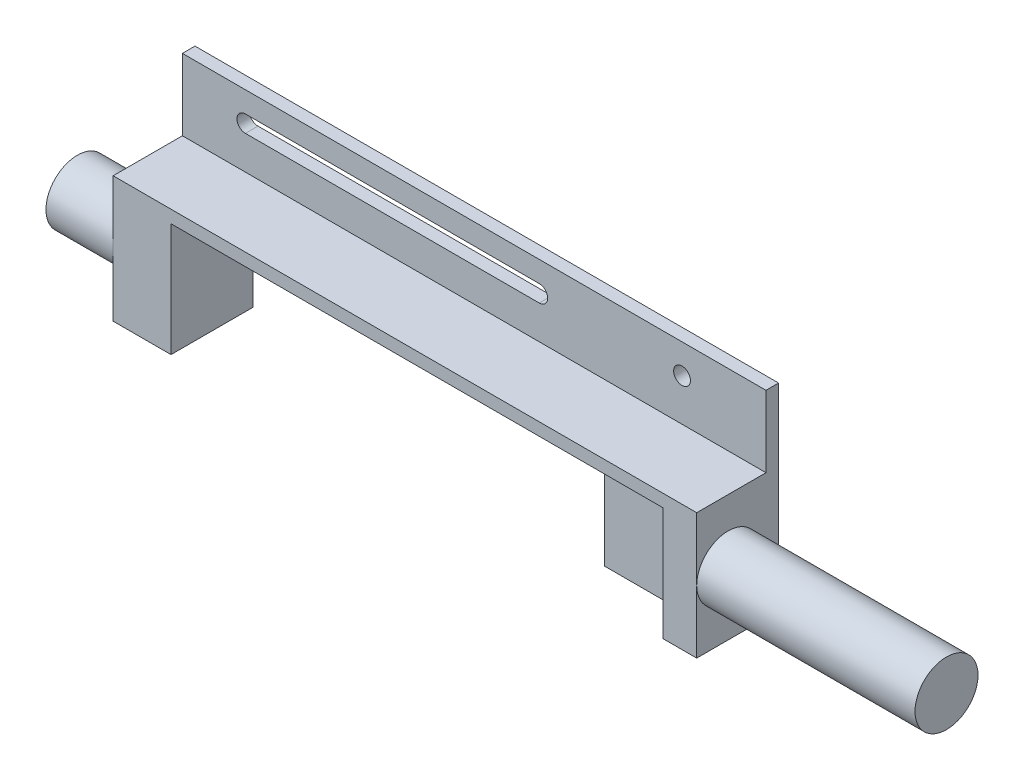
from build123d import *

# Parameters (mm, degrees)
BOSS_EXTRUDE1_DEPTH     = 139
SKETCH3_R               = 2
CUT_EXTRUDE1_DEPTH      = 153.647469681
SKETCH5_W               = 30
SKETCH5_H               = 60
BOSS_EXTRUDE2_DEPTH     = 13.7
SKETCH6_W               = 27.582278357
SKETCH6_H               = 4.25
SKETCH6_W_2             = 27.382278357
BOSS_EXTRUDE3_DEPTH     = 10
CUT_EXTRUDE3_DEPTH      = 132.062650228
CUT_EXTRUDE3_DEPTH_BACK = 132.062650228
SKETCH7_R               = 1
SKETCH4_R               = 7.5
BOSS_EXTRUDE4_DEPTH     = 52
BOSS_EXTRUDE5_START     = -155
SKETCH4_2_R             = 7.5
BOSS_EXTRUDE5_DEPTH     = 155
SKETCH8_W               = 30
SKETCH8_H               = 13.7
CUT_EXTRUDE4_DEPTH      = 18.85
SKETCH9_W               = 95.207004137
SKETCH9_H               = 27
CUT_EXTRUDE5_DEPTH      = 202.60032242
SKETCH10_W              = 139
SKETCH10_H              = 30
CUT_EXTRUDE6_DEPTH      = 16.5
CUT_EXTRUDE7_DEPTH      = 203.936541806
CUT_EXTRUDE7_DEPTH_BACK = 13.7
SKETCH11_W              = 30
SKETCH11_H              = 45.211643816
SKETCH12_W              = 139
SKETCH12_H              = 13
CUT_EXTRUDE8_DEPTH      = 202.149819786
CUT_EXTRUDE9_REACH      = 199.662
SKETCH13_R              = 2.5
SKETCH14_W              = 22
SKETCH14_H              = 27
CUT_EXTRUDE10_DEPTH     = 8


with BuildPart() as part:
    # Sketch2 → Boss-Extrude1 (new body)
    with BuildSketch(Plane(origin=(0, 0, 0), x_dir=(0, 0, -1), z_dir=(1, 0, 0))):
        Polygon((-6.75, 30), (6.75, 30), (6.75, 60), (9.75, 60), (9.75, 51.134717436), (9.75, 0), (-9.75, 0), (-9.75, 60), (-6.75, 60), align=None)
    extrude(amount=BOSS_EXTRUDE1_DEPTH)

    # Sketch3 → Cut-Extrude1 (cut, through all)
    with BuildSketch(Plane(origin=(0, 0, -9.75), x_dir=(-1, 0, 0), z_dir=(0, 0, -1))):
        with Locations((-119, 40)):
            Circle(SKETCH3_R)
        with BuildLine():
            Line((-85, 42), (-15, 42))
            ThreePointArc((-15, 42), (-13, 40), (-15, 38))
            Line((-15, 38), (-85, 38))
            ThreePointArc((-85, 38), (-87, 40), (-85, 42))
        make_face()
    extrude(amount=-CUT_EXTRUDE1_DEPTH, mode=Mode.SUBTRACT)

    # Sketch5 → Boss-Extrude2 (add)
    with BuildSketch(Plane(origin=(0, 0, -9.75), x_dir=(-1, 0, 0), z_dir=(0, 0, -1))):
        with Locations((-124, 30)):
            Rectangle(SKETCH5_W, SKETCH5_H)
    extrude(amount=BOSS_EXTRUDE2_DEPTH)

    # Sketch6 → Boss-Extrude3 (add)
    with BuildSketch(Plane(origin=(0, 0, -23.45), x_dir=(-1, 0, 0), z_dir=(0, 0, -1))):
        with Locations((-125.208860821, 20.975)):
            Rectangle(SKETCH6_W, SKETCH6_H)
        with Locations((-125.308860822, 48.775)):
            Rectangle(SKETCH6_W_2, SKETCH6_H)
    extrude(amount=BOSS_EXTRUDE3_DEPTH)

    # Sketch7 → Cut-Extrude3 (cut, two sides: drawn at the far end of the back side and taken through both)
    with BuildSketch(Plane.ZY.offset(-111.617721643).offset(-CUT_EXTRUDE3_DEPTH_BACK)):
        with Locations((-30.95, 48.78)):
            Circle(SKETCH7_R)
        with Locations((-30.95, 20.97)):
            Circle(SKETCH7_R)
    extrude(amount=CUT_EXTRUDE3_DEPTH + CUT_EXTRUDE3_DEPTH_BACK, mode=Mode.SUBTRACT)

    # Sketch4 → Boss-Extrude4 (add)
    with BuildSketch(Plane(origin=(139, 0, 0), x_dir=(0, 0, -1), z_dir=(1, 0, 0))):
        with Locations(Location((-2.25, 15, 0), (0, 0, 180))):
            Circle(SKETCH4_R)
    extrude(amount=BOSS_EXTRUDE4_DEPTH)

    # Sketch4_2 → Boss-Extrude5 (add)
    with BuildSketch(Plane(origin=(139, 0, 0), x_dir=(0, 0, -1), z_dir=(1, 0, 0)).offset(BOSS_EXTRUDE5_START)):
        with Locations(Location((-2.25, 15, 0), (0, 0, 180))):
            Circle(SKETCH4_2_R)
    extrude(amount=BOSS_EXTRUDE5_DEPTH)

    # Sketch8 → Cut-Extrude4 (cut)
    with BuildSketch(Plane.XZ):
        with Locations((124, -16.6)):
            Rectangle(SKETCH8_W, SKETCH8_H)
    extrude(amount=-CUT_EXTRUDE4_DEPTH, mode=Mode.SUBTRACT)

    # Sketch9 → Cut-Extrude5 (cut, through all)
    with BuildSketch(Plane(origin=(0, 0, -9.75), x_dir=(-1, 0, 0), z_dir=(0, 0, -1))):
        with Locations((-61.396497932, 13.5)):
            Rectangle(SKETCH9_W, SKETCH9_H)
    extrude(amount=-CUT_EXTRUDE5_DEPTH, mode=Mode.SUBTRACT)

    # Sketch10 → Cut-Extrude6 (cut)
    with BuildSketch(Plane.XY.offset(9.75)):
        with Locations((69.5, 45)):
            Rectangle(SKETCH10_W, SKETCH10_H)
    extrude(amount=-CUT_EXTRUDE6_DEPTH, mode=Mode.SUBTRACT)

    # Sketch11 → Cut-Extrude7 (cut, two sides: drawn at the far end of the back side and taken through both)
    with BuildSketch(Plane(origin=(0, 0, -23.45), x_dir=(-1, 0, 0), z_dir=(0, 0, -1)).offset(-CUT_EXTRUDE7_DEPTH_BACK)):
        with Locations((-124, 37.394178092)):
            Rectangle(SKETCH11_W, SKETCH11_H)
    extrude(amount=CUT_EXTRUDE7_DEPTH + CUT_EXTRUDE7_DEPTH_BACK, mode=Mode.SUBTRACT)

    # Sketch12 → Cut-Extrude8 (cut, through all)
    with BuildSketch(Plane(origin=(0, 0, -9.75), x_dir=(-1, 0, 0), z_dir=(0, 0, -1))):
        with Locations((-69.5, 53.5)):
            Rectangle(SKETCH12_W, SKETCH12_H)
    extrude(amount=-CUT_EXTRUDE8_DEPTH, mode=Mode.SUBTRACT)

    # Sketch13 → Cut-Extrude9 (cut, up to next)
    with BuildSketch(Plane(origin=(0, 0, -9.75), x_dir=(-1, 0, 0), z_dir=(0, 0, -1)), mode=Mode.PRIVATE) as cut_extrude9_sk1:
        with Locations((-126, 7)):
            Circle(SKETCH13_R)
    cut_extrude9_tool1 = extrude(cut_extrude9_sk1.sketch, amount=-CUT_EXTRUDE9_REACH, mode=Mode.PRIVATE) & part.part
    # Sketch13 → Cut-Extrude9 (cut, up to next)
    with BuildSketch(Plane(origin=(0, 0, -9.75), x_dir=(-1, 0, 0), z_dir=(0, 0, -1)), mode=Mode.PRIVATE) as cut_extrude9_sk2:
        with Locations((-126, 17)):
            Circle(SKETCH13_R)
    cut_extrude9_tool2 = extrude(cut_extrude9_sk2.sketch, amount=-CUT_EXTRUDE9_REACH, mode=Mode.PRIVATE) & part.part
    add(cut_extrude9_tool1.solids().sort_by_distance((126, 7, -9.75))[0], mode=Mode.SUBTRACT)
    add(cut_extrude9_tool2.solids().sort_by_distance((126, 17, -9.75))[0], mode=Mode.SUBTRACT)

    # Sketch14 → Cut-Extrude10 (cut)
    with BuildSketch(Plane.XY.offset(9.75)):
        with Locations((120, 13.5)):
            Rectangle(SKETCH14_W, SKETCH14_H)
    extrude(amount=-CUT_EXTRUDE10_DEPTH, mode=Mode.SUBTRACT)


solid = part.part
